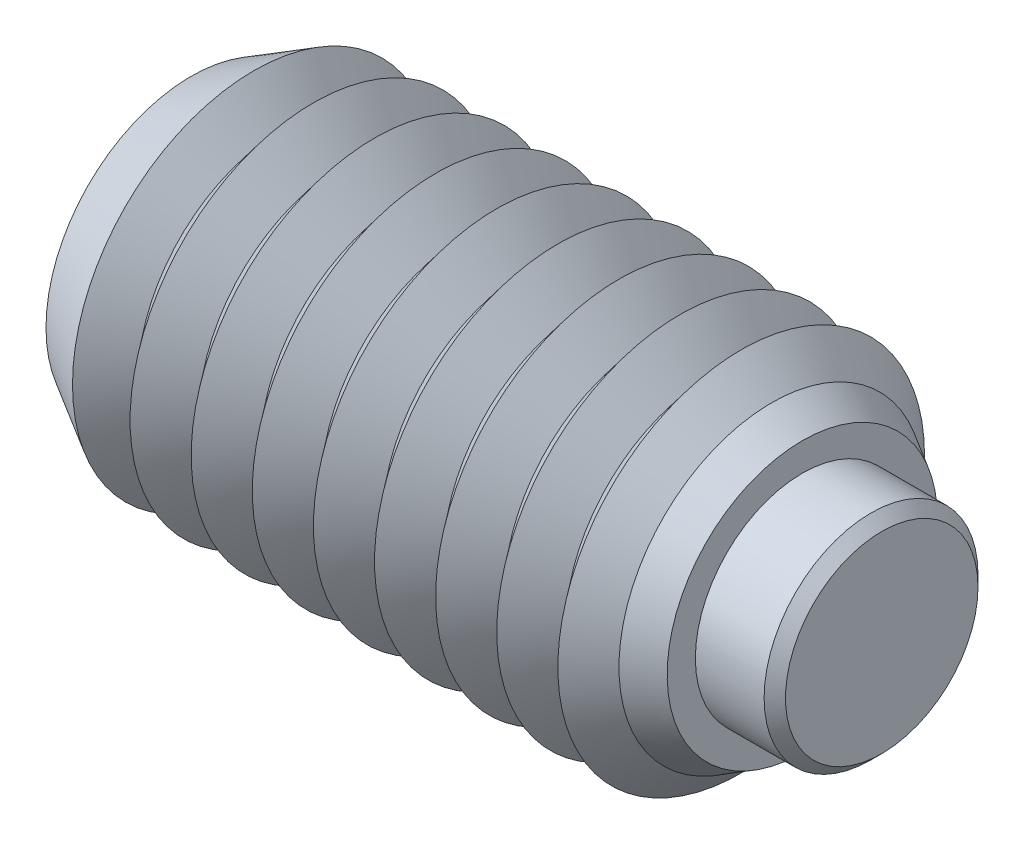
ISO-10303-21;
HEADER;
FILE_DESCRIPTION(('STEP AP214'),'2;1');
FILE_NAME('part.step','',(''),(''),'','','');
FILE_SCHEMA(('AUTOMOTIVE_DESIGN { 1 0 10303 214 1 1 1 1 }'));
ENDSEC;
DATA;
#1=APPLICATION_CONTEXT('core data for automotive mechanical design processes');
#2=APPLICATION_PROTOCOL_DEFINITION('international standard','automotive_design',2000,#1);
#3=PRODUCT_CONTEXT('',#1,'mechanical');
#4=PRODUCT('Part','Part','',(#3));
#5=PRODUCT_RELATED_PRODUCT_CATEGORY('part','',(#4));
#6=PRODUCT_DEFINITION_FORMATION('','',#4);
#7=PRODUCT_DEFINITION_CONTEXT('part definition',#1,'design');
#8=PRODUCT_DEFINITION('design','',#6,#7);
#9=PRODUCT_DEFINITION_SHAPE('','',#8);
#10=(LENGTH_UNIT() NAMED_UNIT(*) SI_UNIT(.MILLI.,.METRE.));
#11=(NAMED_UNIT(*) PLANE_ANGLE_UNIT() SI_UNIT($,.RADIAN.));
#12=(NAMED_UNIT(*) SI_UNIT($,.STERADIAN.) SOLID_ANGLE_UNIT());
#13=UNCERTAINTY_MEASURE_WITH_UNIT(LENGTH_MEASURE(1.E-05),#10,'distance_accuracy_value','');
#14=(GEOMETRIC_REPRESENTATION_CONTEXT(3) GLOBAL_UNCERTAINTY_ASSIGNED_CONTEXT((#13)) GLOBAL_UNIT_ASSIGNED_CONTEXT((#10,
#11,#12)) REPRESENTATION_CONTEXT('',''));
#15=CARTESIAN_POINT('',(0.,0.,0.));
#16=DIRECTION('',(0.,0.,1.));
#17=DIRECTION('',(1.,0.,0.));
#18=AXIS2_PLACEMENT_3D('',#15,#16,#17);
#19=CARTESIAN_POINT('',(1.8,0.,0.));
#20=DIRECTION('',(-1.,0.,0.));
#21=DIRECTION('',(0.,0.,1.));
#22=AXIS2_PLACEMENT_3D('',#19,#20,#21);
#23=CYLINDRICAL_SURFACE('',#22,1.75);
#24=CARTESIAN_POINT('',(1.625,0.,0.));
#25=DIRECTION('',(1.,0.,0.));
#26=DIRECTION('',(0.,0.,-1.));
#27=AXIS2_PLACEMENT_3D('',#24,#25,#26);
#28=CIRCLE('',#27,1.75);
#29=CARTESIAN_POINT('',(1.625,0.,-1.75));
#30=VERTEX_POINT('',#29);
#31=EDGE_CURVE('P0_E10',#30,#30,#28,.F.);
#32=ORIENTED_EDGE('',*,*,#31,.T.);
#33=EDGE_LOOP('',(#32));
#34=FACE_BOUND('',#33,.T.);
#35=CARTESIAN_POINT('',(-0.8,0.,0.));
#36=DIRECTION('',(1.,0.,0.));
#37=DIRECTION('',(0.,0.,-1.));
#38=AXIS2_PLACEMENT_3D('',#35,#36,#37);
#39=CIRCLE('',#38,1.75);
#40=CARTESIAN_POINT('',(-0.8,0.,-1.75));
#41=VERTEX_POINT('',#40);
#42=EDGE_CURVE('P0_E25',#41,#41,#39,.T.);
#43=ORIENTED_EDGE('',*,*,#42,.T.);
#44=EDGE_LOOP('',(#43));
#45=FACE_BOUND('',#44,.T.);
#46=ADVANCED_FACE('P0_F14',(#34,#45),#23,.T.);
#47=CARTESIAN_POINT('',(1.8,0.,0.));
#48=DIRECTION('',(1.,0.,0.));
#49=DIRECTION('',(0.,0.,-1.));
#50=AXIS2_PLACEMENT_3D('',#47,#48,#49);
#51=PLANE('',#50);
#52=CARTESIAN_POINT('',(1.8,0.,0.));
#53=DIRECTION('',(1.,0.,0.));
#54=DIRECTION('',(0.,0.,-1.));
#55=AXIS2_PLACEMENT_3D('',#52,#53,#54);
#56=CIRCLE('',#55,1.575);
#57=CARTESIAN_POINT('',(1.8,0.,-1.575));
#58=VERTEX_POINT('',#57);
#59=EDGE_CURVE('P0_E21',#58,#58,#56,.T.);
#60=ORIENTED_EDGE('',*,*,#59,.T.);
#61=EDGE_LOOP('',(#60));
#62=FACE_BOUND('',#61,.T.);
#63=ADVANCED_FACE('P0_F35',(#62),#51,.T.);
#64=CARTESIAN_POINT('',(-0.8,0.,0.));
#65=DIRECTION('',(1.,0.,0.));
#66=DIRECTION('',(0.,0.,-1.));
#67=AXIS2_PLACEMENT_3D('',#64,#65,#66);
#68=PLANE('',#67);
#69=ORIENTED_EDGE('',*,*,#42,.F.);
#70=EDGE_LOOP('',(#69));
#71=FACE_BOUND('',#70,.T.);
#72=ADVANCED_FACE('P0_F33',(#71),#68,.F.);
#73=CARTESIAN_POINT('',(1.8,0.,0.));
#74=DIRECTION('',(-1.,0.,0.));
#75=DIRECTION('',(0.,0.,1.));
#76=AXIS2_PLACEMENT_3D('',#73,#74,#75);
#77=CONICAL_SURFACE('',#76,1.575,0.785398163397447);
#78=ORIENTED_EDGE('',*,*,#31,.F.);
#79=EDGE_LOOP('',(#78));
#80=FACE_BOUND('',#79,.T.);
#81=ORIENTED_EDGE('',*,*,#59,.F.);
#82=EDGE_LOOP('',(#81));
#83=FACE_BOUND('',#82,.T.);
#84=ADVANCED_FACE('P0_F16',(#80,#83),#77,.T.);
#85=CLOSED_SHELL('',(#46,#63,#72,#84));
#86=MANIFOLD_SOLID_BREP('P0_B1',#85);
#87=CARTESIAN_POINT('',(-8.5,0.,0.));
#88=DIRECTION('',(-1.,0.,0.));
#89=DIRECTION('',(0.,0.,1.));
#90=AXIS2_PLACEMENT_3D('',#87,#88,#89);
#91=CONICAL_SURFACE('',#90,3.,0.895664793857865);
#92=CARTESIAN_POINT('',(-8.,0.,0.));
#93=DIRECTION('',(1.,0.,0.));
#94=DIRECTION('',(0.,0.,-1.));
#95=AXIS2_PLACEMENT_3D('',#92,#93,#94);
#96=CIRCLE('',#95,2.37550020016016);
#97=CARTESIAN_POINT('',(-8.,0.,-2.37550020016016));
#98=VERTEX_POINT('',#97);
#99=EDGE_CURVE('P1_E697',#98,#98,#96,.T.);
#100=ORIENTED_EDGE('',*,*,#99,.F.);
#101=EDGE_LOOP('',(#100));
#102=FACE_BOUND('',#101,.T.);
#103=CARTESIAN_POINT('',(-8.47418373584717,0.,0.));
#104=DIRECTION('',(1.,0.,0.));
#105=DIRECTION('',(0.,0.,-1.));
#106=AXIS2_PLACEMENT_3D('',#103,#104,#105);
#107=CIRCLE('',#106,2.96775549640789);
#108=CARTESIAN_POINT('',(-8.47418373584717,0.,-2.96775549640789));
#109=VERTEX_POINT('',#108);
#110=EDGE_CURVE('P1_E700',#109,#109,#107,.F.);
#111=ORIENTED_EDGE('',*,*,#110,.F.);
#112=EDGE_LOOP('',(#111));
#113=FACE_BOUND('',#112,.T.);
#114=ADVANCED_FACE('P1_F15',(#102,#113),#91,.T.);
#115=CARTESIAN_POINT('',(-0.999999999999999,0.,0.));
#116=DIRECTION('',(1.,0.,0.));
#117=DIRECTION('',(0.,0.,-1.));
#118=AXIS2_PLACEMENT_3D('',#115,#116,#117);
#119=CONICAL_SURFACE('',#118,2.37550020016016,0.895664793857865);
#120=CARTESIAN_POINT('',(-0.499999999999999,0.,0.));
#121=DIRECTION('',(1.,0.,0.));
#122=DIRECTION('',(0.,0.,-1.));
#123=AXIS2_PLACEMENT_3D('',#120,#121,#122);
#124=CIRCLE('',#123,3.);
#125=CARTESIAN_POINT('',(-0.499999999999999,0.,-3.));
#126=VERTEX_POINT('',#125);
#127=EDGE_CURVE('P1_E651',#126,#126,#124,.T.);
#128=ORIENTED_EDGE('',*,*,#127,.F.);
#129=EDGE_LOOP('',(#128));
#130=FACE_BOUND('',#129,.T.);
#131=CARTESIAN_POINT('',(-0.999999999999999,0.,0.));
#132=DIRECTION('',(1.,0.,0.));
#133=DIRECTION('',(0.,0.,-1.));
#134=AXIS2_PLACEMENT_3D('',#131,#132,#133);
#135=CIRCLE('',#134,2.37550020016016);
#136=CARTESIAN_POINT('',(-0.999999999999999,0.,-2.37550020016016));
#137=VERTEX_POINT('',#136);
#138=EDGE_CURVE('P1_E652',#137,#137,#135,.T.);
#139=ORIENTED_EDGE('',*,*,#138,.T.);
#140=EDGE_LOOP('',(#139));
#141=FACE_BOUND('',#140,.T.);
#142=ADVANCED_FACE('P1_F222',(#130,#141),#119,.T.);
#143=CARTESIAN_POINT('',(-1.5,0.,0.));
#144=DIRECTION('',(-1.,0.,0.));
#145=DIRECTION('',(0.,0.,1.));
#146=AXIS2_PLACEMENT_3D('',#143,#144,#145);
#147=CONICAL_SURFACE('',#146,3.,0.895664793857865);
#148=ORIENTED_EDGE('',*,*,#138,.F.);
#149=EDGE_LOOP('',(#148));
#150=FACE_BOUND('',#149,.T.);
#151=CARTESIAN_POINT('',(-1.5,0.,0.));
#152=DIRECTION('',(1.,0.,0.));
#153=DIRECTION('',(0.,0.,-1.));
#154=AXIS2_PLACEMENT_3D('',#151,#152,#153);
#155=CIRCLE('',#154,3.);
#156=CARTESIAN_POINT('',(-1.5,0.,-3.));
#157=VERTEX_POINT('',#156);
#158=EDGE_CURVE('P1_E656',#157,#157,#155,.T.);
#159=ORIENTED_EDGE('',*,*,#158,.T.);
#160=EDGE_LOOP('',(#159));
#161=FACE_BOUND('',#160,.T.);
#162=ADVANCED_FACE('P1_F227',(#150,#161),#147,.T.);
#163=CARTESIAN_POINT('',(-0.8,0.,0.));
#164=DIRECTION('',(1.,0.,0.));
#165=DIRECTION('',(0.,1.,0.));
#166=AXIS2_PLACEMENT_3D('',#163,#164,#165);
#167=PLANE('',#166);
#168=CARTESIAN_POINT('',(-0.8,0.,0.));
#169=DIRECTION('',(1.,0.,0.));
#170=DIRECTION('',(0.,1.,0.));
#171=AXIS2_PLACEMENT_3D('',#168,#169,#170);
#172=CIRCLE('',#171,1.75);
#173=CARTESIAN_POINT('',(-0.8,1.75,0.));
#174=VERTEX_POINT('',#173);
#175=EDGE_CURVE('P1_E358',#174,#174,#172,.T.);
#176=ORIENTED_EDGE('',*,*,#175,.T.);
#177=EDGE_LOOP('',(#176));
#178=FACE_BOUND('',#177,.T.);
#179=ADVANCED_FACE('P1_F285',(#178),#167,.T.);
#180=CARTESIAN_POINT('',(-0.8,0.,0.));
#181=DIRECTION('',(1.,0.,0.));
#182=DIRECTION('',(0.,1.,0.));
#183=AXIS2_PLACEMENT_3D('',#180,#181,#182);
#184=CYLINDRICAL_SURFACE('',#183,1.75);
#185=ORIENTED_EDGE('',*,*,#175,.F.);
#186=EDGE_LOOP('',(#185));
#187=FACE_BOUND('',#186,.T.);
#188=CARTESIAN_POINT('',(0.5,0.,0.));
#189=DIRECTION('',(1.,0.,0.));
#190=DIRECTION('',(0.,1.,0.));
#191=AXIS2_PLACEMENT_3D('',#188,#189,#190);
#192=CIRCLE('',#191,1.75);
#193=CARTESIAN_POINT('',(0.5,1.75,0.));
#194=VERTEX_POINT('',#193);
#195=EDGE_CURVE('P1_E361',#194,#194,#192,.T.);
#196=ORIENTED_EDGE('',*,*,#195,.T.);
#197=EDGE_LOOP('',(#196));
#198=FACE_BOUND('',#197,.T.);
#199=ADVANCED_FACE('P1_F209',(#187,#198),#184,.F.);
#200=CARTESIAN_POINT('',(0.5,2.21132486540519,0.));
#201=DIRECTION('',(1.,0.,0.));
#202=DIRECTION('',(0.,1.,0.));
#203=AXIS2_PLACEMENT_3D('',#200,#201,#202);
#204=PLANE('',#203);
#205=ORIENTED_EDGE('',*,*,#195,.F.);
#206=EDGE_LOOP('',(#205));
#207=FACE_BOUND('',#206,.T.);
#208=CARTESIAN_POINT('',(0.5,0.,0.));
#209=DIRECTION('',(1.,0.,0.));
#210=DIRECTION('',(0.,1.,0.));
#211=AXIS2_PLACEMENT_3D('',#208,#209,#210);
#212=CIRCLE('',#211,2.21132486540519);
#213=CARTESIAN_POINT('',(0.5,2.21132486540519,0.));
#214=VERTEX_POINT('',#213);
#215=EDGE_CURVE('P1_E121',#214,#214,#212,.T.);
#216=ORIENTED_EDGE('',*,*,#215,.T.);
#217=EDGE_LOOP('',(#216));
#218=FACE_BOUND('',#217,.T.);
#219=ADVANCED_FACE('P1_F206',(#207,#218),#204,.T.);
#220=CARTESIAN_POINT('',(0.5,0.,0.));
#221=DIRECTION('',(-1.,0.,0.));
#222=DIRECTION('',(0.,-1.,0.));
#223=AXIS2_PLACEMENT_3D('',#220,#221,#222);
#224=CONICAL_SURFACE('',#223,2.21132486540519,0.523598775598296);
#225=CARTESIAN_POINT('',(0.,0.,0.));
#226=DIRECTION('',(1.,0.,0.));
#227=DIRECTION('',(0.,0.,-1.));
#228=AXIS2_PLACEMENT_3D('',#225,#226,#227);
#229=CIRCLE('',#228,2.5);
#230=CARTESIAN_POINT('',(0.,0.,-2.5));
#231=VERTEX_POINT('',#230);
#232=EDGE_CURVE('P1_E349',#231,#231,#229,.T.);
#233=ORIENTED_EDGE('',*,*,#232,.T.);
#234=EDGE_LOOP('',(#233));
#235=FACE_BOUND('',#234,.T.);
#236=ORIENTED_EDGE('',*,*,#215,.F.);
#237=EDGE_LOOP('',(#236));
#238=FACE_BOUND('',#237,.T.);
#239=ADVANCED_FACE('P1_F203',(#235,#238),#224,.T.);
#240=CARTESIAN_POINT('',(0.,0.,0.));
#241=DIRECTION('',(-1.,0.,0.));
#242=DIRECTION('',(0.,0.,1.));
#243=AXIS2_PLACEMENT_3D('',#240,#241,#242);
#244=CONICAL_SURFACE('',#243,2.5,0.785398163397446);
#245=ORIENTED_EDGE('',*,*,#127,.T.);
#246=EDGE_LOOP('',(#245));
#247=FACE_BOUND('',#246,.T.);
#248=ORIENTED_EDGE('',*,*,#232,.F.);
#249=EDGE_LOOP('',(#248));
#250=FACE_BOUND('',#249,.T.);
#251=ADVANCED_FACE('P1_F17',(#247,#250),#244,.T.);
#252=CARTESIAN_POINT('',(-2.,0.,0.));
#253=DIRECTION('',(1.,0.,0.));
#254=DIRECTION('',(0.,0.,-1.));
#255=AXIS2_PLACEMENT_3D('',#252,#253,#254);
#256=CONICAL_SURFACE('',#255,2.37550020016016,0.895664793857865);
#257=ORIENTED_EDGE('',*,*,#158,.F.);
#258=EDGE_LOOP('',(#257));
#259=FACE_BOUND('',#258,.T.);
#260=CARTESIAN_POINT('',(-2.,0.,0.));
#261=DIRECTION('',(1.,0.,0.));
#262=DIRECTION('',(0.,0.,-1.));
#263=AXIS2_PLACEMENT_3D('',#260,#261,#262);
#264=CIRCLE('',#263,2.37550020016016);
#265=CARTESIAN_POINT('',(-2.,0.,-2.37550020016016));
#266=VERTEX_POINT('',#265);
#267=EDGE_CURVE('P1_E661',#266,#266,#264,.T.);
#268=ORIENTED_EDGE('',*,*,#267,.T.);
#269=EDGE_LOOP('',(#268));
#270=FACE_BOUND('',#269,.T.);
#271=ADVANCED_FACE('P1_F279',(#259,#270),#256,.T.);
#272=CARTESIAN_POINT('',(-2.5,0.,0.));
#273=DIRECTION('',(-1.,0.,0.));
#274=DIRECTION('',(0.,0.,1.));
#275=AXIS2_PLACEMENT_3D('',#272,#273,#274);
#276=CONICAL_SURFACE('',#275,3.,0.895664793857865);
#277=ORIENTED_EDGE('',*,*,#267,.F.);
#278=EDGE_LOOP('',(#277));
#279=FACE_BOUND('',#278,.T.);
#280=CARTESIAN_POINT('',(-2.5,0.,0.));
#281=DIRECTION('',(1.,0.,0.));
#282=DIRECTION('',(0.,0.,-1.));
#283=AXIS2_PLACEMENT_3D('',#280,#281,#282);
#284=CIRCLE('',#283,3.);
#285=CARTESIAN_POINT('',(-2.5,0.,-3.));
#286=VERTEX_POINT('',#285);
#287=EDGE_CURVE('P1_E664',#286,#286,#284,.T.);
#288=ORIENTED_EDGE('',*,*,#287,.T.);
#289=EDGE_LOOP('',(#288));
#290=FACE_BOUND('',#289,.T.);
#291=ADVANCED_FACE('P1_F275',(#279,#290),#276,.T.);
#292=CARTESIAN_POINT('',(-3.,0.,0.));
#293=DIRECTION('',(1.,0.,0.));
#294=DIRECTION('',(0.,0.,-1.));
#295=AXIS2_PLACEMENT_3D('',#292,#293,#294);
#296=CONICAL_SURFACE('',#295,2.37550020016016,0.895664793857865);
#297=ORIENTED_EDGE('',*,*,#287,.F.);
#298=EDGE_LOOP('',(#297));
#299=FACE_BOUND('',#298,.T.);
#300=CARTESIAN_POINT('',(-3.,0.,0.));
#301=DIRECTION('',(1.,0.,0.));
#302=DIRECTION('',(0.,0.,-1.));
#303=AXIS2_PLACEMENT_3D('',#300,#301,#302);
#304=CIRCLE('',#303,2.37550020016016);
#305=CARTESIAN_POINT('',(-3.,0.,-2.37550020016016));
#306=VERTEX_POINT('',#305);
#307=EDGE_CURVE('P1_E667',#306,#306,#304,.T.);
#308=ORIENTED_EDGE('',*,*,#307,.T.);
#309=EDGE_LOOP('',(#308));
#310=FACE_BOUND('',#309,.T.);
#311=ADVANCED_FACE('P1_F271',(#299,#310),#296,.T.);
#312=CARTESIAN_POINT('',(-3.5,0.,0.));
#313=DIRECTION('',(-1.,0.,0.));
#314=DIRECTION('',(0.,0.,1.));
#315=AXIS2_PLACEMENT_3D('',#312,#313,#314);
#316=CONICAL_SURFACE('',#315,3.,0.895664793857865);
#317=ORIENTED_EDGE('',*,*,#307,.F.);
#318=EDGE_LOOP('',(#317));
#319=FACE_BOUND('',#318,.T.);
#320=CARTESIAN_POINT('',(-3.5,0.,0.));
#321=DIRECTION('',(1.,0.,0.));
#322=DIRECTION('',(0.,0.,-1.));
#323=AXIS2_PLACEMENT_3D('',#320,#321,#322);
#324=CIRCLE('',#323,3.);
#325=CARTESIAN_POINT('',(-3.5,0.,-3.));
#326=VERTEX_POINT('',#325);
#327=EDGE_CURVE('P1_E670',#326,#326,#324,.T.);
#328=ORIENTED_EDGE('',*,*,#327,.T.);
#329=EDGE_LOOP('',(#328));
#330=FACE_BOUND('',#329,.T.);
#331=ADVANCED_FACE('P1_F267',(#319,#330),#316,.T.);
#332=CARTESIAN_POINT('',(-4.,0.,0.));
#333=DIRECTION('',(1.,0.,0.));
#334=DIRECTION('',(0.,0.,-1.));
#335=AXIS2_PLACEMENT_3D('',#332,#333,#334);
#336=CONICAL_SURFACE('',#335,2.37550020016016,0.895664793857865);
#337=ORIENTED_EDGE('',*,*,#327,.F.);
#338=EDGE_LOOP('',(#337));
#339=FACE_BOUND('',#338,.T.);
#340=CARTESIAN_POINT('',(-4.,0.,0.));
#341=DIRECTION('',(1.,0.,0.));
#342=DIRECTION('',(0.,0.,-1.));
#343=AXIS2_PLACEMENT_3D('',#340,#341,#342);
#344=CIRCLE('',#343,2.37550020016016);
#345=CARTESIAN_POINT('',(-4.,0.,-2.37550020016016));
#346=VERTEX_POINT('',#345);
#347=EDGE_CURVE('P1_E673',#346,#346,#344,.T.);
#348=ORIENTED_EDGE('',*,*,#347,.T.);
#349=EDGE_LOOP('',(#348));
#350=FACE_BOUND('',#349,.T.);
#351=ADVANCED_FACE('P1_F263',(#339,#350),#336,.T.);
#352=CARTESIAN_POINT('',(-4.5,0.,0.));
#353=DIRECTION('',(-1.,0.,0.));
#354=DIRECTION('',(0.,0.,1.));
#355=AXIS2_PLACEMENT_3D('',#352,#353,#354);
#356=CONICAL_SURFACE('',#355,3.,0.895664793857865);
#357=ORIENTED_EDGE('',*,*,#347,.F.);
#358=EDGE_LOOP('',(#357));
#359=FACE_BOUND('',#358,.T.);
#360=CARTESIAN_POINT('',(-4.5,0.,0.));
#361=DIRECTION('',(1.,0.,0.));
#362=DIRECTION('',(0.,0.,-1.));
#363=AXIS2_PLACEMENT_3D('',#360,#361,#362);
#364=CIRCLE('',#363,3.);
#365=CARTESIAN_POINT('',(-4.5,0.,-3.));
#366=VERTEX_POINT('',#365);
#367=EDGE_CURVE('P1_E676',#366,#366,#364,.T.);
#368=ORIENTED_EDGE('',*,*,#367,.T.);
#369=EDGE_LOOP('',(#368));
#370=FACE_BOUND('',#369,.T.);
#371=ADVANCED_FACE('P1_F259',(#359,#370),#356,.T.);
#372=CARTESIAN_POINT('',(-5.,0.,0.));
#373=DIRECTION('',(1.,0.,0.));
#374=DIRECTION('',(0.,0.,-1.));
#375=AXIS2_PLACEMENT_3D('',#372,#373,#374);
#376=CONICAL_SURFACE('',#375,2.37550020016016,0.895664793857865);
#377=ORIENTED_EDGE('',*,*,#367,.F.);
#378=EDGE_LOOP('',(#377));
#379=FACE_BOUND('',#378,.T.);
#380=CARTESIAN_POINT('',(-5.,0.,0.));
#381=DIRECTION('',(1.,0.,0.));
#382=DIRECTION('',(0.,0.,-1.));
#383=AXIS2_PLACEMENT_3D('',#380,#381,#382);
#384=CIRCLE('',#383,2.37550020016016);
#385=CARTESIAN_POINT('',(-5.,0.,-2.37550020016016));
#386=VERTEX_POINT('',#385);
#387=EDGE_CURVE('P1_E679',#386,#386,#384,.T.);
#388=ORIENTED_EDGE('',*,*,#387,.T.);
#389=EDGE_LOOP('',(#388));
#390=FACE_BOUND('',#389,.T.);
#391=ADVANCED_FACE('P1_F255',(#379,#390),#376,.T.);
#392=CARTESIAN_POINT('',(-5.5,0.,0.));
#393=DIRECTION('',(-1.,0.,0.));
#394=DIRECTION('',(0.,0.,1.));
#395=AXIS2_PLACEMENT_3D('',#392,#393,#394);
#396=CONICAL_SURFACE('',#395,3.,0.895664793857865);
#397=ORIENTED_EDGE('',*,*,#387,.F.);
#398=EDGE_LOOP('',(#397));
#399=FACE_BOUND('',#398,.T.);
#400=CARTESIAN_POINT('',(-5.5,0.,0.));
#401=DIRECTION('',(1.,0.,0.));
#402=DIRECTION('',(0.,0.,-1.));
#403=AXIS2_PLACEMENT_3D('',#400,#401,#402);
#404=CIRCLE('',#403,3.);
#405=CARTESIAN_POINT('',(-5.5,0.,-3.));
#406=VERTEX_POINT('',#405);
#407=EDGE_CURVE('P1_E682',#406,#406,#404,.T.);
#408=ORIENTED_EDGE('',*,*,#407,.T.);
#409=EDGE_LOOP('',(#408));
#410=FACE_BOUND('',#409,.T.);
#411=ADVANCED_FACE('P1_F251',(#399,#410),#396,.T.);
#412=CARTESIAN_POINT('',(-6.,0.,0.));
#413=DIRECTION('',(1.,0.,0.));
#414=DIRECTION('',(0.,0.,-1.));
#415=AXIS2_PLACEMENT_3D('',#412,#413,#414);
#416=CONICAL_SURFACE('',#415,2.37550020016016,0.895664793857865);
#417=ORIENTED_EDGE('',*,*,#407,.F.);
#418=EDGE_LOOP('',(#417));
#419=FACE_BOUND('',#418,.T.);
#420=CARTESIAN_POINT('',(-6.,0.,0.));
#421=DIRECTION('',(1.,0.,0.));
#422=DIRECTION('',(0.,0.,-1.));
#423=AXIS2_PLACEMENT_3D('',#420,#421,#422);
#424=CIRCLE('',#423,2.37550020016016);
#425=CARTESIAN_POINT('',(-6.,0.,-2.37550020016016));
#426=VERTEX_POINT('',#425);
#427=EDGE_CURVE('P1_E685',#426,#426,#424,.T.);
#428=ORIENTED_EDGE('',*,*,#427,.T.);
#429=EDGE_LOOP('',(#428));
#430=FACE_BOUND('',#429,.T.);
#431=ADVANCED_FACE('P1_F247',(#419,#430),#416,.T.);
#432=CARTESIAN_POINT('',(-6.5,0.,0.));
#433=DIRECTION('',(-1.,0.,0.));
#434=DIRECTION('',(0.,0.,1.));
#435=AXIS2_PLACEMENT_3D('',#432,#433,#434);
#436=CONICAL_SURFACE('',#435,3.,0.895664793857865);
#437=ORIENTED_EDGE('',*,*,#427,.F.);
#438=EDGE_LOOP('',(#437));
#439=FACE_BOUND('',#438,.T.);
#440=CARTESIAN_POINT('',(-6.5,0.,0.));
#441=DIRECTION('',(1.,0.,0.));
#442=DIRECTION('',(0.,0.,-1.));
#443=AXIS2_PLACEMENT_3D('',#440,#441,#442);
#444=CIRCLE('',#443,3.);
#445=CARTESIAN_POINT('',(-6.5,0.,-3.));
#446=VERTEX_POINT('',#445);
#447=EDGE_CURVE('P1_E688',#446,#446,#444,.T.);
#448=ORIENTED_EDGE('',*,*,#447,.T.);
#449=EDGE_LOOP('',(#448));
#450=FACE_BOUND('',#449,.T.);
#451=ADVANCED_FACE('P1_F243',(#439,#450),#436,.T.);
#452=CARTESIAN_POINT('',(-7.,0.,0.));
#453=DIRECTION('',(1.,0.,0.));
#454=DIRECTION('',(0.,0.,-1.));
#455=AXIS2_PLACEMENT_3D('',#452,#453,#454);
#456=CONICAL_SURFACE('',#455,2.37550020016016,0.895664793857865);
#457=ORIENTED_EDGE('',*,*,#447,.F.);
#458=EDGE_LOOP('',(#457));
#459=FACE_BOUND('',#458,.T.);
#460=CARTESIAN_POINT('',(-7.,0.,0.));
#461=DIRECTION('',(1.,0.,0.));
#462=DIRECTION('',(0.,0.,-1.));
#463=AXIS2_PLACEMENT_3D('',#460,#461,#462);
#464=CIRCLE('',#463,2.37550020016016);
#465=CARTESIAN_POINT('',(-7.,0.,-2.37550020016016));
#466=VERTEX_POINT('',#465);
#467=EDGE_CURVE('P1_E691',#466,#466,#464,.T.);
#468=ORIENTED_EDGE('',*,*,#467,.T.);
#469=EDGE_LOOP('',(#468));
#470=FACE_BOUND('',#469,.T.);
#471=ADVANCED_FACE('P1_F239',(#459,#470),#456,.T.);
#472=CARTESIAN_POINT('',(-7.5,0.,0.));
#473=DIRECTION('',(-1.,0.,0.));
#474=DIRECTION('',(0.,0.,1.));
#475=AXIS2_PLACEMENT_3D('',#472,#473,#474);
#476=CONICAL_SURFACE('',#475,3.,0.895664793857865);
#477=ORIENTED_EDGE('',*,*,#467,.F.);
#478=EDGE_LOOP('',(#477));
#479=FACE_BOUND('',#478,.T.);
#480=CARTESIAN_POINT('',(-7.5,0.,0.));
#481=DIRECTION('',(1.,0.,0.));
#482=DIRECTION('',(0.,0.,-1.));
#483=AXIS2_PLACEMENT_3D('',#480,#481,#482);
#484=CIRCLE('',#483,3.);
#485=CARTESIAN_POINT('',(-7.5,0.,-3.));
#486=VERTEX_POINT('',#485);
#487=EDGE_CURVE('P1_E694',#486,#486,#484,.T.);
#488=ORIENTED_EDGE('',*,*,#487,.T.);
#489=EDGE_LOOP('',(#488));
#490=FACE_BOUND('',#489,.T.);
#491=ADVANCED_FACE('P1_F235',(#479,#490),#476,.T.);
#492=CARTESIAN_POINT('',(-8.,0.,0.));
#493=DIRECTION('',(1.,0.,0.));
#494=DIRECTION('',(0.,0.,-1.));
#495=AXIS2_PLACEMENT_3D('',#492,#493,#494);
#496=CONICAL_SURFACE('',#495,2.37550020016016,0.895664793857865);
#497=ORIENTED_EDGE('',*,*,#487,.F.);
#498=EDGE_LOOP('',(#497));
#499=FACE_BOUND('',#498,.T.);
#500=ORIENTED_EDGE('',*,*,#99,.T.);
#501=EDGE_LOOP('',(#500));
#502=FACE_BOUND('',#501,.T.);
#503=ADVANCED_FACE('P1_F219',(#499,#502),#496,.T.);
#504=CARTESIAN_POINT('',(-9.5,0.,0.));
#505=DIRECTION('',(1.,0.,0.));
#506=DIRECTION('',(0.,0.,1.));
#507=AXIS2_PLACEMENT_3D('',#504,#505,#506);
#508=CONICAL_SURFACE('',#507,2.37550020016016,0.5235987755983);
#509=CARTESIAN_POINT('',(-9.5,0.,0.));
#510=DIRECTION('',(-1.,0.,0.));
#511=DIRECTION('',(0.,0.,1.));
#512=AXIS2_PLACEMENT_3D('',#509,#510,#511);
#513=CIRCLE('',#512,2.37550020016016);
#514=CARTESIAN_POINT('',(-9.5,0.,2.37550020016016));
#515=VERTEX_POINT('',#514);
#516=EDGE_CURVE('P1_E702',#515,#515,#513,.T.);
#517=ORIENTED_EDGE('',*,*,#516,.F.);
#518=EDGE_LOOP('',(#517));
#519=FACE_BOUND('',#518,.T.);
#520=ORIENTED_EDGE('',*,*,#110,.T.);
#521=EDGE_LOOP('',(#520));
#522=FACE_BOUND('',#521,.T.);
#523=ADVANCED_FACE('P1_F159',(#519,#522),#508,.T.);
#524=CARTESIAN_POINT('',(-9.5,0.,0.));
#525=DIRECTION('',(1.,0.,0.));
#526=DIRECTION('',(0.,0.,-1.));
#527=AXIS2_PLACEMENT_3D('',#524,#525,#526);
#528=PLANE('',#527);
#529=CARTESIAN_POINT('',(-9.5,0.,0.));
#530=DIRECTION('',(1.,0.,0.));
#531=DIRECTION('',(0.,0.,-1.));
#532=AXIS2_PLACEMENT_3D('',#529,#530,#531);
#533=CIRCLE('',#532,1.73205080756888);
#534=CARTESIAN_POINT('',(-9.5,-1.5,-0.866025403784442));
#535=VERTEX_POINT('',#534);
#536=CARTESIAN_POINT('',(-9.5,0.,-1.73205080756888));
#537=VERTEX_POINT('',#536);
#538=EDGE_CURVE('P1_E19',#535,#537,#533,.T.);
#539=ORIENTED_EDGE('',*,*,#538,.T.);
#540=CARTESIAN_POINT('',(-9.5,1.5,-0.866025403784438));
#541=VERTEX_POINT('',#540);
#542=EDGE_CURVE('P1_E10',#537,#541,#533,.T.);
#543=ORIENTED_EDGE('',*,*,#542,.T.);
#544=CARTESIAN_POINT('',(-9.5,1.5,0.866025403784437));
#545=VERTEX_POINT('',#544);
#546=EDGE_CURVE('P1_E24',#541,#545,#533,.T.);
#547=ORIENTED_EDGE('',*,*,#546,.T.);
#548=CARTESIAN_POINT('',(-9.5,0.,0.));
#549=DIRECTION('',(-1.,0.,0.));
#550=DIRECTION('',(0.,0.,1.));
#551=AXIS2_PLACEMENT_3D('',#548,#549,#550);
#552=CIRCLE('',#551,1.73205080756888);
#553=CARTESIAN_POINT('',(-9.5,0.,1.73205080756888));
#554=VERTEX_POINT('',#553);
#555=EDGE_CURVE('P1_E92',#554,#545,#552,.T.);
#556=ORIENTED_EDGE('',*,*,#555,.F.);
#557=CARTESIAN_POINT('',(-9.5,-1.5,0.86602540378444));
#558=VERTEX_POINT('',#557);
#559=EDGE_CURVE('P1_E101',#554,#558,#533,.T.);
#560=ORIENTED_EDGE('',*,*,#559,.T.);
#561=EDGE_CURVE('P1_E107',#558,#535,#533,.T.);
#562=ORIENTED_EDGE('',*,*,#561,.T.);
#563=EDGE_LOOP('',(#539,#543,#547,#556,#560,#562));
#564=FACE_BOUND('',#563,.T.);
#565=ORIENTED_EDGE('',*,*,#516,.T.);
#566=EDGE_LOOP('',(#565));
#567=FACE_BOUND('',#566,.T.);
#568=ADVANCED_FACE('P1_F108',(#564,#567),#528,.F.);
#569=CARTESIAN_POINT('',(-9.5,0.,0.));
#570=DIRECTION('',(-1.,0.,0.));
#571=DIRECTION('',(0.,0.,1.));
#572=AXIS2_PLACEMENT_3D('',#569,#570,#571);
#573=CONICAL_SURFACE('',#572,1.73205080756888,1.0471975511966);
#574=ORIENTED_EDGE('',*,*,#538,.F.);
#575=CARTESIAN_POINT('',(-9.50006667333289,0.000199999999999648,-1.73216627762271));
#576=CARTESIAN_POINT('',(-9.47808285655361,-0.065719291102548,-1.69410775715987));
#577=CARTESIAN_POINT('',(-9.45808888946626,-0.132207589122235,-1.65572072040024));
#578=CARTESIAN_POINT('',(-9.42318810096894,-0.26633566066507,-1.5782818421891));
#579=CARTESIAN_POINT('',(-9.4082936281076,-0.333977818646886,-1.53922862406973));
#580=CARTESIAN_POINT('',(-9.38510668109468,-0.468423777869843,-1.4616062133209));
#581=CARTESIAN_POINT('',(-9.37665991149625,-0.535206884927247,-1.42304896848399));
#582=CARTESIAN_POINT('',(-9.36657357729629,-0.66908756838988,-1.34575291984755));
#583=CARTESIAN_POINT('',(-9.36492566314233,-0.736184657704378,-1.30701439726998));
#584=CARTESIAN_POINT('',(-9.36834162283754,-0.861574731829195,-1.23462040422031));
#585=CARTESIAN_POINT('',(-9.37256675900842,-0.919886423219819,-1.20095413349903));
#586=CARTESIAN_POINT('',(-9.38596177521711,-1.03612987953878,-1.13384094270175));
#587=CARTESIAN_POINT('',(-9.39513623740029,-1.09406124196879,-1.10039425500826));
#588=CARTESIAN_POINT('',(-9.41807318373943,-1.21054465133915,-1.03314252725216));
#589=CARTESIAN_POINT('',(-9.43193296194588,-1.26908194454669,-0.99934600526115));
#590=CARTESIAN_POINT('',(-9.46338978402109,-1.38528312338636,-0.932257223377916));
#591=CARTESIAN_POINT('',(-9.48097942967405,-1.44294849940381,-0.89896410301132));
#592=CARTESIAN_POINT('',(-9.50006667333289,-1.5002,-0.8659099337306));
#593=B_SPLINE_CURVE_WITH_KNOTS('',3,(#575,#576,#577,#578,#579,#580,#581,#582,#583,#584,#585,
#586,#587,#588,#589,#590,#591,#592),.UNSPECIFIED.,.F.,.F.,(4,2,2,2,2,2,2,2,4),(0.,
0.237777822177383,0.476127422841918,0.708577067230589,0.940741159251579,1.1429435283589,
1.34533342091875,1.55221450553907,1.75868901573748),.UNSPECIFIED.);
#594=EDGE_CURVE('P1_E130',#537,#535,#593,.T.);
#595=ORIENTED_EDGE('',*,*,#594,.F.);
#596=EDGE_LOOP('',(#574,#595));
#597=FACE_BOUND('',#596,.T.);
#598=ADVANCED_FACE('P1_F158',(#597),#573,.F.);
#599=ORIENTED_EDGE('',*,*,#561,.F.);
#600=CARTESIAN_POINT('',(-10.0577529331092,-1.5,-2.2427176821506));
#601=CARTESIAN_POINT('',(-10.0266762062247,-1.5,-2.17794242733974));
#602=CARTESIAN_POINT('',(-9.99592234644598,-1.5,-2.11300950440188));
#603=CARTESIAN_POINT('',(-9.93524331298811,-1.5,-1.98274395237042));
#604=CARTESIAN_POINT('',(-9.90531828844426,-1.5,-1.91741125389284));
#605=CARTESIAN_POINT('',(-9.84631270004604,-1.5,-1.78588718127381));
#606=CARTESIAN_POINT('',(-9.8172383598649,-1.5,-1.71969300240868));
#607=CARTESIAN_POINT('',(-9.76039408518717,-1.5,-1.58675026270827));
#608=CARTESIAN_POINT('',(-9.73262408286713,-1.5,-1.52000173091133));
#609=CARTESIAN_POINT('',(-9.6780255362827,-1.5,-1.38408099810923));
#610=CARTESIAN_POINT('',(-9.65124057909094,-1.5,-1.3148910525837));
#611=CARTESIAN_POINT('',(-9.59990657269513,-1.5,-1.17568930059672));
#612=CARTESIAN_POINT('',(-9.57535780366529,-1.5,-1.10567739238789));
#613=CARTESIAN_POINT('',(-9.5061010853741,-1.5,-0.894522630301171));
#614=CARTESIAN_POINT('',(-9.46562025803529,-1.5,-0.751874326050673));
#615=CARTESIAN_POINT('',(-9.4186644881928,-1.5,-0.535047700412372));
#616=CARTESIAN_POINT('',(-9.40531287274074,-1.5,-0.46236564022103));
#617=CARTESIAN_POINT('',(-9.3841134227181,-1.5,-0.316183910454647));
#618=CARTESIAN_POINT('',(-9.37626521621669,-1.5,-0.242684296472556));
#619=CARTESIAN_POINT('',(-9.36679853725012,-1.5,-0.0961589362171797));
#620=CARTESIAN_POINT('',(-9.36510654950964,-1.5,-0.0231380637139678));
#621=CARTESIAN_POINT('',(-9.36789942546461,-1.5,0.122783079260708));
#622=CARTESIAN_POINT('',(-9.37238467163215,-1.5,0.195683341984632));
#623=CARTESIAN_POINT('',(-9.39067763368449,-1.5,0.375553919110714));
#624=CARTESIAN_POINT('',(-9.40791349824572,-1.5,0.482175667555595));
#625=CARTESIAN_POINT('',(-9.45235981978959,-1.5,0.693345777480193));
#626=CARTESIAN_POINT('',(-9.47958229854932,-1.5,0.797891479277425));
#627=CARTESIAN_POINT('',(-9.52608494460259,-1.5,0.954251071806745));
#628=CARTESIAN_POINT('',(-9.54274753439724,-1.5,1.00687320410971));
#629=CARTESIAN_POINT('',(-9.57761409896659,-1.5,1.11156970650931));
#630=CARTESIAN_POINT('',(-9.59581711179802,-1.5,1.16364439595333));
#631=CARTESIAN_POINT('',(-9.63350016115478,-1.5,1.26731560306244));
#632=CARTESIAN_POINT('',(-9.65297996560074,-1.5,1.31891220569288));
#633=CARTESIAN_POINT('',(-9.69300589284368,-1.5,1.42169884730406));
#634=CARTESIAN_POINT('',(-9.71355219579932,-1.5,1.47288881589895));
#635=CARTESIAN_POINT('',(-9.76731366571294,-1.5,1.60355339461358));
#636=CARTESIAN_POINT('',(-9.80116315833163,-1.5,1.68276673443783));
#637=CARTESIAN_POINT('',(-9.87049388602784,-1.5,1.84047808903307));
#638=CARTESIAN_POINT('',(-9.90597524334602,-1.5,1.91897604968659));
#639=CARTESIAN_POINT('',(-10.0142918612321,-1.5,2.15363522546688));
#640=CARTESIAN_POINT('',(-10.0889885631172,-1.5,2.3089355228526));
#641=CARTESIAN_POINT('',(-10.2415147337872,-1.5,2.61820933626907));
#642=CARTESIAN_POINT('',(-10.3193479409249,-1.5,2.77218098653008));
#643=CARTESIAN_POINT('',(-10.4770156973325,-1.5,3.07906936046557));
#644=CARTESIAN_POINT('',(-10.5568499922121,-1.5,3.23198621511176));
#645=CARTESIAN_POINT('',(-10.7102968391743,-1.5,3.52269097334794));
#646=CARTESIAN_POINT('',(-10.7837854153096,-1.5,3.66054454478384));
#647=CARTESIAN_POINT('',(-10.9315998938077,-1.5,3.93580825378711));
#648=CARTESIAN_POINT('',(-11.0059258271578,-1.5,4.07321837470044));
#649=CARTESIAN_POINT('',(-11.1550151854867,-1.5,4.34734790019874));
#650=CARTESIAN_POINT('',(-11.2297770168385,-1.5,4.48406817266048));
#651=CARTESIAN_POINT('',(-11.3797872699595,-1.5,4.75723230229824));
#652=CARTESIAN_POINT('',(-11.4550356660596,-1.5,4.89367617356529));
#653=CARTESIAN_POINT('',(-11.53046248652,-1.5,5.03002074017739));
#654=B_SPLINE_CURVE_WITH_KNOTS('',3,(#600,#601,#602,#603,#604,#605,#606,#607,#608,#609,#610,
#611,#612,#613,#614,#615,#616,#617,#618,#619,#620,#621,#622,#623,#624,#625,#626,#627,#628,#629,
#630,#631,#632,#633,#634,#635,#636,#637,#638,#639,#640,#641,#642,#643,#644,#645,#646,#647,#648,
#649,#650,#651,#652,#653),.UNSPECIFIED.,.F.,.F.,(4,2,2,2,2,2,2,2,2,2,2,2,2,2,2,2,2,2,2,2,2,2,2,
2,2,2,4),(0.,0.215535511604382,0.431109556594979,0.647991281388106,0.864861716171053,
1.08740133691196,1.30996880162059,1.75384817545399,1.97537465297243,2.19688615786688,
2.41574360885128,2.63461461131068,2.95796757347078,3.28171106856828,3.44728442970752,
3.61275514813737,3.77819587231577,3.94366463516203,4.20206568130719,4.46048611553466,
4.97741233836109,5.49497404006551,6.01247027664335,6.48112210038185,6.94979132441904,
7.41726847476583,7.88472116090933),.UNSPECIFIED.);
#655=EDGE_CURVE('P1_E128',#535,#558,#654,.T.);
#656=ORIENTED_EDGE('',*,*,#655,.F.);
#657=EDGE_LOOP('',(#599,#656));
#658=FACE_BOUND('',#657,.T.);
#659=ADVANCED_FACE('P1_F217',(#658),#573,.F.);
#660=ORIENTED_EDGE('',*,*,#559,.F.);
#661=CARTESIAN_POINT('',(-9.50006667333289,-1.5002,0.865909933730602));
#662=CARTESIAN_POINT('',(-9.47808285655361,-1.43428070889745,0.903968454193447));
#663=CARTESIAN_POINT('',(-9.45808888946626,-1.36779241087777,0.942355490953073));
#664=CARTESIAN_POINT('',(-9.42318810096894,-1.23366433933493,1.01979436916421));
#665=CARTESIAN_POINT('',(-9.4082936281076,-1.16602218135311,1.05884758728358));
#666=CARTESIAN_POINT('',(-9.38510668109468,-1.03157622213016,1.13646999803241));
#667=CARTESIAN_POINT('',(-9.37665991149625,-0.964793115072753,1.17502724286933));
#668=CARTESIAN_POINT('',(-9.36657357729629,-0.83091243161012,1.25232329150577));
#669=CARTESIAN_POINT('',(-9.36492566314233,-0.763815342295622,1.29106181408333));
#670=CARTESIAN_POINT('',(-9.36834162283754,-0.638425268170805,1.363455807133));
#671=CARTESIAN_POINT('',(-9.37256675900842,-0.580113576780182,1.39712207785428));
#672=CARTESIAN_POINT('',(-9.38596177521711,-0.463870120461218,1.46423526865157));
#673=CARTESIAN_POINT('',(-9.39513623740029,-0.405938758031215,1.49768195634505));
#674=CARTESIAN_POINT('',(-9.41807318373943,-0.289455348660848,1.56493368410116));
#675=CARTESIAN_POINT('',(-9.43193296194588,-0.230918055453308,1.59873020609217));
#676=CARTESIAN_POINT('',(-9.4633897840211,-0.11471687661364,1.6658189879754));
#677=CARTESIAN_POINT('',(-9.48097942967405,-0.0570515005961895,1.699112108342));
#678=CARTESIAN_POINT('',(-9.50006667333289,0.000199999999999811,1.73216627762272));
#679=B_SPLINE_CURVE_WITH_KNOTS('',3,(#661,#662,#663,#664,#665,#666,#667,#668,#669,#670,#671,
#672,#673,#674,#675,#676,#677,#678),.UNSPECIFIED.,.F.,.F.,(4,2,2,2,2,2,2,2,4),(0.,
0.237777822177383,0.476127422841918,0.708577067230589,0.940741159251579,1.1429435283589,
1.34533342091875,1.55221450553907,1.75868901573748),.UNSPECIFIED.);
#680=EDGE_CURVE('P1_E96',#558,#554,#679,.T.);
#681=ORIENTED_EDGE('',*,*,#680,.F.);
#682=EDGE_LOOP('',(#660,#681));
#683=FACE_BOUND('',#682,.T.);
#684=ADVANCED_FACE('P1_F102',(#683),#573,.F.);
#685=ORIENTED_EDGE('',*,*,#555,.T.);
#686=CARTESIAN_POINT('',(-9.50006667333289,-0.000200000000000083,1.73216627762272));
#687=CARTESIAN_POINT('',(-9.47808285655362,0.0657192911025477,1.69410775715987));
#688=CARTESIAN_POINT('',(-9.45808888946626,0.132207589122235,1.65572072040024));
#689=CARTESIAN_POINT('',(-9.42318810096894,0.26633566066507,1.5782818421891));
#690=CARTESIAN_POINT('',(-9.40829362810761,0.333977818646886,1.53922862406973));
#691=CARTESIAN_POINT('',(-9.38510668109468,0.468423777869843,1.4616062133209));
#692=CARTESIAN_POINT('',(-9.37665991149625,0.535206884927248,1.42304896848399));
#693=CARTESIAN_POINT('',(-9.36657357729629,0.669087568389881,1.34575291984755));
#694=CARTESIAN_POINT('',(-9.36492566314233,0.736184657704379,1.30701439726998));
#695=CARTESIAN_POINT('',(-9.36834162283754,0.861574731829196,1.23462040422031));
#696=CARTESIAN_POINT('',(-9.37256675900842,0.91988642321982,1.20095413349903));
#697=CARTESIAN_POINT('',(-9.38596177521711,1.03612987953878,1.13384094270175));
#698=CARTESIAN_POINT('',(-9.39513623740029,1.09406124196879,1.10039425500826));
#699=CARTESIAN_POINT('',(-9.41807318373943,1.21054465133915,1.03314252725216));
#700=CARTESIAN_POINT('',(-9.43193296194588,1.26908194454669,0.999346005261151));
#701=CARTESIAN_POINT('',(-9.4633897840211,1.38528312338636,0.932257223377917));
#702=CARTESIAN_POINT('',(-9.48097942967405,1.44294849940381,0.898964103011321));
#703=CARTESIAN_POINT('',(-9.50006667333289,1.5002,0.865909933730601));
#704=B_SPLINE_CURVE_WITH_KNOTS('',3,(#686,#687,#688,#689,#690,#691,#692,#693,#694,#695,#696,
#697,#698,#699,#700,#701,#702,#703),.UNSPECIFIED.,.F.,.F.,(4,2,2,2,2,2,2,2,4),(0.,
0.237777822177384,0.476127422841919,0.70857706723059,0.940741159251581,1.14294352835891,
1.34533342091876,1.55221450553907,1.75868901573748),.UNSPECIFIED.);
#705=EDGE_CURVE('P1_E88',#554,#545,#704,.T.);
#706=ORIENTED_EDGE('',*,*,#705,.F.);
#707=EDGE_LOOP('',(#685,#706));
#708=FACE_BOUND('',#707,.T.);
#709=ADVANCED_FACE('P1_F90',(#708),#573,.F.);
#710=ORIENTED_EDGE('',*,*,#546,.F.);
#711=CARTESIAN_POINT('',(-10.0577529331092,1.5,-2.2427176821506));
#712=CARTESIAN_POINT('',(-10.0266762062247,1.5,-2.17794242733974));
#713=CARTESIAN_POINT('',(-9.99592234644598,1.5,-2.11300950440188));
#714=CARTESIAN_POINT('',(-9.93524331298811,1.5,-1.98274395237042));
#715=CARTESIAN_POINT('',(-9.90531828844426,1.5,-1.91741125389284));
#716=CARTESIAN_POINT('',(-9.84631270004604,1.5,-1.78588718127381));
#717=CARTESIAN_POINT('',(-9.81723835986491,1.5,-1.71969300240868));
#718=CARTESIAN_POINT('',(-9.76039408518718,1.5,-1.58675026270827));
#719=CARTESIAN_POINT('',(-9.73262408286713,1.5,-1.52000173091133));
#720=CARTESIAN_POINT('',(-9.6780255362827,1.5,-1.38408099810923));
#721=CARTESIAN_POINT('',(-9.65124057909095,1.5,-1.31489105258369));
#722=CARTESIAN_POINT('',(-9.59990657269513,1.5,-1.17568930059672));
#723=CARTESIAN_POINT('',(-9.57535780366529,1.5,-1.10567739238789));
#724=CARTESIAN_POINT('',(-9.5061010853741,1.5,-0.89452263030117));
#725=CARTESIAN_POINT('',(-9.46562025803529,1.5,-0.751874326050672));
#726=CARTESIAN_POINT('',(-9.4186644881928,1.5,-0.535047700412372));
#727=CARTESIAN_POINT('',(-9.40531287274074,1.5,-0.46236564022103));
#728=CARTESIAN_POINT('',(-9.38411342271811,1.5,-0.316183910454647));
#729=CARTESIAN_POINT('',(-9.37626521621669,1.5,-0.242684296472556));
#730=CARTESIAN_POINT('',(-9.36679853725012,1.5,-0.0961589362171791));
#731=CARTESIAN_POINT('',(-9.36510654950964,1.5,-0.0231380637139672));
#732=CARTESIAN_POINT('',(-9.36789942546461,1.5,0.122783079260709));
#733=CARTESIAN_POINT('',(-9.37238467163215,1.5,0.195683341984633));
#734=CARTESIAN_POINT('',(-9.39067763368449,1.5,0.375553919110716));
#735=CARTESIAN_POINT('',(-9.40791349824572,1.5,0.482175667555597));
#736=CARTESIAN_POINT('',(-9.45235981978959,1.5,0.693345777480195));
#737=CARTESIAN_POINT('',(-9.47958229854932,1.5,0.797891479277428));
#738=CARTESIAN_POINT('',(-9.5260849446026,1.5,0.954251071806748));
#739=CARTESIAN_POINT('',(-9.54274753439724,1.5,1.00687320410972));
#740=CARTESIAN_POINT('',(-9.57761409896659,1.5,1.11156970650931));
#741=CARTESIAN_POINT('',(-9.59581711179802,1.5,1.16364439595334));
#742=CARTESIAN_POINT('',(-9.63350016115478,1.5,1.26731560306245));
#743=CARTESIAN_POINT('',(-9.65297996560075,1.5,1.31891220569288));
#744=CARTESIAN_POINT('',(-9.69300589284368,1.5,1.42169884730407));
#745=CARTESIAN_POINT('',(-9.71355219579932,1.5,1.47288881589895));
#746=CARTESIAN_POINT('',(-9.76731366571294,1.5,1.60355339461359));
#747=CARTESIAN_POINT('',(-9.80116315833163,1.5,1.68276673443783));
#748=CARTESIAN_POINT('',(-9.87049388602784,1.5,1.84047808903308));
#749=CARTESIAN_POINT('',(-9.90597524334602,1.5,1.9189760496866));
#750=CARTESIAN_POINT('',(-10.0142918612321,1.5,2.15363522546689));
#751=CARTESIAN_POINT('',(-10.0889885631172,1.5,2.3089355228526));
#752=CARTESIAN_POINT('',(-10.2415147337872,1.5,2.61820933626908));
#753=CARTESIAN_POINT('',(-10.3193479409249,1.5,2.77218098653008));
#754=CARTESIAN_POINT('',(-10.4770156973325,1.5,3.07906936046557));
#755=CARTESIAN_POINT('',(-10.5568499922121,1.5,3.23198621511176));
#756=CARTESIAN_POINT('',(-10.7102968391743,1.5,3.52269097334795));
#757=CARTESIAN_POINT('',(-10.7837854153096,1.5,3.66054454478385));
#758=CARTESIAN_POINT('',(-10.9315998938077,1.5,3.93580825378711));
#759=CARTESIAN_POINT('',(-11.0059258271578,1.5,4.07321837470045));
#760=CARTESIAN_POINT('',(-11.1550151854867,1.5,4.34734790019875));
#761=CARTESIAN_POINT('',(-11.2297770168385,1.5,4.48406817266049));
#762=CARTESIAN_POINT('',(-11.3797872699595,1.5,4.75723230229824));
#763=CARTESIAN_POINT('',(-11.4550356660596,1.5,4.8936761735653));
#764=CARTESIAN_POINT('',(-11.53046248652,1.5,5.0300207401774));
#765=B_SPLINE_CURVE_WITH_KNOTS('',3,(#711,#712,#713,#714,#715,#716,#717,#718,#719,#720,#721,
#722,#723,#724,#725,#726,#727,#728,#729,#730,#731,#732,#733,#734,#735,#736,#737,#738,#739,#740,
#741,#742,#743,#744,#745,#746,#747,#748,#749,#750,#751,#752,#753,#754,#755,#756,#757,#758,#759,
#760,#761,#762,#763,#764),.UNSPECIFIED.,.F.,.F.,(4,2,2,2,2,2,2,2,2,2,2,2,2,2,2,2,2,2,2,2,2,2,2,
2,2,2,4),(0.,0.215535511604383,0.431109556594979,0.647991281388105,0.864861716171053,
1.08740133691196,1.30996880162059,1.75384817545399,1.97537465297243,2.19688615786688,
2.41574360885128,2.63461461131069,2.95796757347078,3.28171106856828,3.44728442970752,
3.61275514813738,3.77819587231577,3.94366463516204,4.20206568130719,4.46048611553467,
4.97741233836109,5.49497404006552,6.01247027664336,6.48112210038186,6.94979132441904,
7.41726847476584,7.88472116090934),.UNSPECIFIED.);
#766=EDGE_CURVE('P1_E97',#545,#541,#765,.F.);
#767=ORIENTED_EDGE('',*,*,#766,.F.);
#768=EDGE_LOOP('',(#710,#767));
#769=FACE_BOUND('',#768,.T.);
#770=ADVANCED_FACE('P1_F157',(#769),#573,.F.);
#771=ORIENTED_EDGE('',*,*,#542,.F.);
#772=CARTESIAN_POINT('',(-9.50006667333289,1.5002,-0.8659099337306));
#773=CARTESIAN_POINT('',(-9.47808285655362,1.43428070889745,-0.903968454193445));
#774=CARTESIAN_POINT('',(-9.45808888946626,1.36779241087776,-0.942355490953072));
#775=CARTESIAN_POINT('',(-9.42318810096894,1.23366433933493,-1.01979436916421));
#776=CARTESIAN_POINT('',(-9.40829362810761,1.16602218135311,-1.05884758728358));
#777=CARTESIAN_POINT('',(-9.38510668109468,1.03157622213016,-1.13646999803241));
#778=CARTESIAN_POINT('',(-9.37665991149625,0.964793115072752,-1.17502724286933));
#779=CARTESIAN_POINT('',(-9.36657357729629,0.830912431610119,-1.25232329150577));
#780=CARTESIAN_POINT('',(-9.36492566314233,0.763815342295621,-1.29106181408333));
#781=CARTESIAN_POINT('',(-9.36834162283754,0.638425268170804,-1.363455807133));
#782=CARTESIAN_POINT('',(-9.37256675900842,0.58011357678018,-1.39712207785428));
#783=CARTESIAN_POINT('',(-9.38596177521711,0.463870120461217,-1.46423526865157));
#784=CARTESIAN_POINT('',(-9.39513623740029,0.405938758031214,-1.49768195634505));
#785=CARTESIAN_POINT('',(-9.41807318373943,0.289455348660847,-1.56493368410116));
#786=CARTESIAN_POINT('',(-9.43193296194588,0.230918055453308,-1.59873020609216));
#787=CARTESIAN_POINT('',(-9.46338978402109,0.11471687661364,-1.6658189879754));
#788=CARTESIAN_POINT('',(-9.48097942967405,0.0570515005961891,-1.69911210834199));
#789=CARTESIAN_POINT('',(-9.50006667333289,-0.000200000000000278,-1.73216627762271));
#790=B_SPLINE_CURVE_WITH_KNOTS('',3,(#772,#773,#774,#775,#776,#777,#778,#779,#780,#781,#782,
#783,#784,#785,#786,#787,#788,#789),.UNSPECIFIED.,.F.,.F.,(4,2,2,2,2,2,2,2,4),(0.,
0.237777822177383,0.476127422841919,0.70857706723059,0.940741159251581,1.1429435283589,
1.34533342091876,1.55221450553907,1.75868901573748),.UNSPECIFIED.);
#791=EDGE_CURVE('P1_E178',#541,#537,#790,.T.);
#792=ORIENTED_EDGE('',*,*,#791,.F.);
#793=EDGE_LOOP('',(#771,#792));
#794=FACE_BOUND('',#793,.T.);
#795=ADVANCED_FACE('P1_F152',(#794),#573,.F.);
#796=CARTESIAN_POINT('',(-5.63397459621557,0.,0.));
#797=DIRECTION('',(-1.,0.,0.));
#798=DIRECTION('',(0.,-1.,0.));
#799=AXIS2_PLACEMENT_3D('',#796,#797,#798);
#800=CONICAL_SURFACE('',#799,0.,1.0471975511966);
#801=CARTESIAN_POINT('',(-6.5,0.,0.));
#802=DIRECTION('',(1.,0.,0.));
#803=DIRECTION('',(0.,1.,0.));
#804=AXIS2_PLACEMENT_3D('',#801,#802,#803);
#805=CIRCLE('',#804,1.5);
#806=CARTESIAN_POINT('',(-6.5,1.5,0.));
#807=VERTEX_POINT('',#806);
#808=CARTESIAN_POINT('',(-6.5,0.75,1.29903810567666));
#809=VERTEX_POINT('',#808);
#810=EDGE_CURVE('P1_E312',#807,#809,#805,.T.);
#811=ORIENTED_EDGE('',*,*,#810,.F.);
#812=CARTESIAN_POINT('',(-6.5,0.75,-1.29903810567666));
#813=VERTEX_POINT('',#812);
#814=EDGE_CURVE('P1_E351',#813,#807,#805,.T.);
#815=ORIENTED_EDGE('',*,*,#814,.F.);
#816=CARTESIAN_POINT('',(-6.5,-0.750000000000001,-1.29903810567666));
#817=VERTEX_POINT('',#816);
#818=EDGE_CURVE('P1_E354',#817,#813,#805,.T.);
#819=ORIENTED_EDGE('',*,*,#818,.F.);
#820=CARTESIAN_POINT('',(-6.5,-1.5,0.));
#821=VERTEX_POINT('',#820);
#822=EDGE_CURVE('P1_E356',#821,#817,#805,.T.);
#823=ORIENTED_EDGE('',*,*,#822,.F.);
#824=CARTESIAN_POINT('',(-6.5,-0.750000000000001,1.29903810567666));
#825=VERTEX_POINT('',#824);
#826=EDGE_CURVE('P1_E364',#825,#821,#805,.T.);
#827=ORIENTED_EDGE('',*,*,#826,.F.);
#828=EDGE_CURVE('P1_E359',#809,#825,#805,.T.);
#829=ORIENTED_EDGE('',*,*,#828,.F.);
#830=EDGE_LOOP('',(#811,#815,#819,#823,#827,#829));
#831=FACE_BOUND('',#830,.T.);
#832=CARTESIAN_POINT('',(-5.63397459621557,0.,0.));
#833=VERTEX_POINT('',#832);
#834=VERTEX_LOOP('',#833);
#835=FACE_BOUND('',#834,.T.);
#836=ADVANCED_FACE('P1_F156',(#831,#835),#800,.F.);
#837=CARTESIAN_POINT('',(-6.5,1.5,0.866025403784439));
#838=DIRECTION('',(-1.,0.,0.));
#839=DIRECTION('',(0.,0.,1.));
#840=AXIS2_PLACEMENT_3D('',#837,#838,#839);
#841=PLANE('',#840);
#842=DIRECTION('',(0.,-0.866025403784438,0.5));
#843=VECTOR('',#842,1.);
#844=CARTESIAN_POINT('',(-6.5,0.,-1.73205080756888));
#845=LINE('',#844,#843);
#846=CARTESIAN_POINT('',(-6.5,0.,-1.73205080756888));
#847=VERTEX_POINT('',#846);
#848=EDGE_CURVE('P1_E325',#847,#817,#845,.T.);
#849=ORIENTED_EDGE('',*,*,#848,.T.);
#850=ORIENTED_EDGE('',*,*,#818,.T.);
#851=DIRECTION('',(0.,-0.866025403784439,-0.5));
#852=VECTOR('',#851,1.);
#853=CARTESIAN_POINT('',(-6.5,1.5,-0.866025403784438));
#854=LINE('',#853,#852);
#855=EDGE_CURVE('P1_E315',#813,#847,#854,.T.);
#856=ORIENTED_EDGE('',*,*,#855,.T.);
#857=EDGE_LOOP('',(#849,#850,#856));
#858=FACE_BOUND('',#857,.T.);
#859=ADVANCED_FACE('P1_F295',(#858),#841,.T.);
#860=DIRECTION('',(0.,0.,1.));
#861=VECTOR('',#860,1.);
#862=CARTESIAN_POINT('',(-6.5,-1.5,-0.866025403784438));
#863=LINE('',#862,#861);
#864=CARTESIAN_POINT('',(-6.5,-1.5,-0.866025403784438));
#865=VERTEX_POINT('',#864);
#866=EDGE_CURVE('P1_E329',#865,#821,#863,.T.);
#867=ORIENTED_EDGE('',*,*,#866,.T.);
#868=ORIENTED_EDGE('',*,*,#822,.T.);
#869=EDGE_CURVE('P1_E324',#817,#865,#845,.T.);
#870=ORIENTED_EDGE('',*,*,#869,.T.);
#871=EDGE_LOOP('',(#867,#868,#870));
#872=FACE_BOUND('',#871,.T.);
#873=ADVANCED_FACE('P1_F371',(#872),#841,.T.);
#874=DIRECTION('',(0.,0.866025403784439,0.5));
#875=VECTOR('',#874,1.);
#876=CARTESIAN_POINT('',(-6.5,-1.5,0.866025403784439));
#877=LINE('',#876,#875);
#878=CARTESIAN_POINT('',(-6.5,-1.5,0.866025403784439));
#879=VERTEX_POINT('',#878);
#880=EDGE_CURVE('P1_E333',#879,#825,#877,.T.);
#881=ORIENTED_EDGE('',*,*,#880,.T.);
#882=ORIENTED_EDGE('',*,*,#826,.T.);
#883=EDGE_CURVE('P1_E328',#821,#879,#863,.T.);
#884=ORIENTED_EDGE('',*,*,#883,.T.);
#885=EDGE_LOOP('',(#881,#882,#884));
#886=FACE_BOUND('',#885,.T.);
#887=ADVANCED_FACE('P1_F306',(#886),#841,.T.);
#888=DIRECTION('',(0.,0.866025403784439,-0.5));
#889=VECTOR('',#888,1.);
#890=CARTESIAN_POINT('',(-6.5,0.,1.73205080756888));
#891=LINE('',#890,#889);
#892=CARTESIAN_POINT('',(-6.5,0.,1.73205080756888));
#893=VERTEX_POINT('',#892);
#894=EDGE_CURVE('P1_E118',#893,#809,#891,.T.);
#895=ORIENTED_EDGE('',*,*,#894,.T.);
#896=ORIENTED_EDGE('',*,*,#828,.T.);
#897=EDGE_CURVE('P1_E332',#825,#893,#877,.T.);
#898=ORIENTED_EDGE('',*,*,#897,.T.);
#899=EDGE_LOOP('',(#895,#896,#898));
#900=FACE_BOUND('',#899,.T.);
#901=ADVANCED_FACE('P1_F299',(#900),#841,.T.);
#902=DIRECTION('',(0.,0.,-1.));
#903=VECTOR('',#902,1.);
#904=CARTESIAN_POINT('',(-6.5,1.5,0.866025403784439));
#905=LINE('',#904,#903);
#906=CARTESIAN_POINT('',(-6.5,1.5,0.866025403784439));
#907=VERTEX_POINT('',#906);
#908=EDGE_CURVE('P1_E311',#907,#807,#905,.T.);
#909=ORIENTED_EDGE('',*,*,#908,.T.);
#910=ORIENTED_EDGE('',*,*,#810,.T.);
#911=EDGE_CURVE('P1_E313',#809,#907,#891,.T.);
#912=ORIENTED_EDGE('',*,*,#911,.T.);
#913=EDGE_LOOP('',(#909,#910,#912));
#914=FACE_BOUND('',#913,.T.);
#915=ADVANCED_FACE('P1_F297',(#914),#841,.T.);
#916=CARTESIAN_POINT('',(-6.5,1.5,-0.866025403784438));
#917=VERTEX_POINT('',#916);
#918=EDGE_CURVE('P1_E318',#917,#813,#854,.T.);
#919=ORIENTED_EDGE('',*,*,#918,.T.);
#920=ORIENTED_EDGE('',*,*,#814,.T.);
#921=EDGE_CURVE('P1_E316',#807,#917,#905,.T.);
#922=ORIENTED_EDGE('',*,*,#921,.T.);
#923=EDGE_LOOP('',(#919,#920,#922));
#924=FACE_BOUND('',#923,.T.);
#925=ADVANCED_FACE('P1_F198',(#924),#841,.T.);
#926=CARTESIAN_POINT('',(-6.5,1.5,0.866025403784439));
#927=DIRECTION('',(0.,1.,0.));
#928=DIRECTION('',(0.,0.,1.));
#929=AXIS2_PLACEMENT_3D('',#926,#927,#928);
#930=PLANE('',#929);
#931=DIRECTION('',(-1.,0.,0.));
#932=VECTOR('',#931,1.);
#933=CARTESIAN_POINT('',(-6.5,1.5,0.866025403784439));
#934=LINE('',#933,#932);
#935=EDGE_CURVE('P1_E335',#907,#545,#934,.T.);
#936=ORIENTED_EDGE('',*,*,#935,.T.);
#937=ORIENTED_EDGE('',*,*,#766,.T.);
#938=DIRECTION('',(-1.,0.,0.));
#939=VECTOR('',#938,1.);
#940=CARTESIAN_POINT('',(-6.5,1.5,-0.866025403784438));
#941=LINE('',#940,#939);
#942=EDGE_CURVE('P1_E344',#917,#541,#941,.T.);
#943=ORIENTED_EDGE('',*,*,#942,.F.);
#944=ORIENTED_EDGE('',*,*,#921,.F.);
#945=ORIENTED_EDGE('',*,*,#908,.F.);
#946=EDGE_LOOP('',(#936,#937,#943,#944,#945));
#947=FACE_BOUND('',#946,.T.);
#948=ADVANCED_FACE('P1_F195',(#947),#930,.F.);
#949=CARTESIAN_POINT('',(-6.5,0.,1.73205080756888));
#950=DIRECTION('',(0.,0.5,0.866025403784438));
#951=DIRECTION('',(0.,-0.866025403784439,0.5));
#952=AXIS2_PLACEMENT_3D('',#949,#950,#951);
#953=PLANE('',#952);
#954=DIRECTION('',(-1.,0.,0.));
#955=VECTOR('',#954,1.);
#956=CARTESIAN_POINT('',(-6.5,0.,1.73205080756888));
#957=LINE('',#956,#955);
#958=EDGE_CURVE('P1_E114',#893,#554,#957,.T.);
#959=ORIENTED_EDGE('',*,*,#958,.T.);
#960=ORIENTED_EDGE('',*,*,#705,.T.);
#961=ORIENTED_EDGE('',*,*,#935,.F.);
#962=ORIENTED_EDGE('',*,*,#911,.F.);
#963=ORIENTED_EDGE('',*,*,#894,.F.);
#964=EDGE_LOOP('',(#959,#960,#961,#962,#963));
#965=FACE_BOUND('',#964,.T.);
#966=ADVANCED_FACE('P1_F115',(#965),#953,.F.);
#967=CARTESIAN_POINT('',(-6.5,-1.5,0.866025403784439));
#968=DIRECTION('',(0.,-0.5,0.866025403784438));
#969=DIRECTION('',(0.,-0.866025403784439,-0.5));
#970=AXIS2_PLACEMENT_3D('',#967,#968,#969);
#971=PLANE('',#970);
#972=DIRECTION('',(-1.,0.,0.));
#973=VECTOR('',#972,1.);
#974=CARTESIAN_POINT('',(-6.5,-1.5,0.866025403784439));
#975=LINE('',#974,#973);
#976=EDGE_CURVE('P1_E122',#879,#558,#975,.T.);
#977=ORIENTED_EDGE('',*,*,#976,.T.);
#978=ORIENTED_EDGE('',*,*,#680,.T.);
#979=ORIENTED_EDGE('',*,*,#958,.F.);
#980=ORIENTED_EDGE('',*,*,#897,.F.);
#981=ORIENTED_EDGE('',*,*,#880,.F.);
#982=EDGE_LOOP('',(#977,#978,#979,#980,#981));
#983=FACE_BOUND('',#982,.T.);
#984=ADVANCED_FACE('P1_F124',(#983),#971,.F.);
#985=CARTESIAN_POINT('',(-6.5,-1.5,-0.866025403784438));
#986=DIRECTION('',(0.,-1.,0.));
#987=DIRECTION('',(0.,0.,-1.));
#988=AXIS2_PLACEMENT_3D('',#985,#986,#987);
#989=PLANE('',#988);
#990=DIRECTION('',(-1.,0.,0.));
#991=VECTOR('',#990,1.);
#992=CARTESIAN_POINT('',(-6.5,-1.5,-0.866025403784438));
#993=LINE('',#992,#991);
#994=EDGE_CURVE('P1_E338',#865,#535,#993,.T.);
#995=ORIENTED_EDGE('',*,*,#994,.T.);
#996=ORIENTED_EDGE('',*,*,#655,.T.);
#997=ORIENTED_EDGE('',*,*,#976,.F.);
#998=ORIENTED_EDGE('',*,*,#883,.F.);
#999=ORIENTED_EDGE('',*,*,#866,.F.);
#1000=EDGE_LOOP('',(#995,#996,#997,#998,#999));
#1001=FACE_BOUND('',#1000,.T.);
#1002=ADVANCED_FACE('P1_F189',(#1001),#989,.F.);
#1003=CARTESIAN_POINT('',(-6.5,0.,-1.73205080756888));
#1004=DIRECTION('',(0.,-0.5,-0.866025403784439));
#1005=DIRECTION('',(0.,0.866025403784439,-0.5));
#1006=AXIS2_PLACEMENT_3D('',#1003,#1004,#1005);
#1007=PLANE('',#1006);
#1008=DIRECTION('',(-1.,0.,0.));
#1009=VECTOR('',#1008,1.);
#1010=CARTESIAN_POINT('',(-6.5,0.,-1.73205080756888));
#1011=LINE('',#1010,#1009);
#1012=EDGE_CURVE('P1_E341',#847,#537,#1011,.T.);
#1013=ORIENTED_EDGE('',*,*,#1012,.T.);
#1014=ORIENTED_EDGE('',*,*,#594,.T.);
#1015=ORIENTED_EDGE('',*,*,#994,.F.);
#1016=ORIENTED_EDGE('',*,*,#869,.F.);
#1017=ORIENTED_EDGE('',*,*,#848,.F.);
#1018=EDGE_LOOP('',(#1013,#1014,#1015,#1016,#1017));
#1019=FACE_BOUND('',#1018,.T.);
#1020=ADVANCED_FACE('P1_F185',(#1019),#1007,.F.);
#1021=CARTESIAN_POINT('',(-6.5,1.5,-0.866025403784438));
#1022=DIRECTION('',(0.,0.5,-0.866025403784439));
#1023=DIRECTION('',(0.,0.866025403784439,0.5));
#1024=AXIS2_PLACEMENT_3D('',#1021,#1022,#1023);
#1025=PLANE('',#1024);
#1026=ORIENTED_EDGE('',*,*,#942,.T.);
#1027=ORIENTED_EDGE('',*,*,#791,.T.);
#1028=ORIENTED_EDGE('',*,*,#1012,.F.);
#1029=ORIENTED_EDGE('',*,*,#855,.F.);
#1030=ORIENTED_EDGE('',*,*,#918,.F.);
#1031=EDGE_LOOP('',(#1026,#1027,#1028,#1029,#1030));
#1032=FACE_BOUND('',#1031,.T.);
#1033=ADVANCED_FACE('P1_F188',(#1032),#1025,.F.);
#1034=CLOSED_SHELL('',(#114,#142,#162,#179,#199,#219,#239,#251,#271,#291,#311,#331,#351,#371,
#391,#411,#431,#451,#471,#491,#503,#523,#568,#598,#659,#684,#709,#770,#795,#836,#859,#873,#887,
#901,#915,#925,#948,#966,#984,#1002,#1020,#1033));
#1035=MANIFOLD_SOLID_BREP('P1_B1',#1034);
#1036=ADVANCED_BREP_SHAPE_REPRESENTATION('',(#18,#86,#1035),#14);
#1037=SHAPE_DEFINITION_REPRESENTATION(#9,#1036);
ENDSEC;
END-ISO-10303-21;
